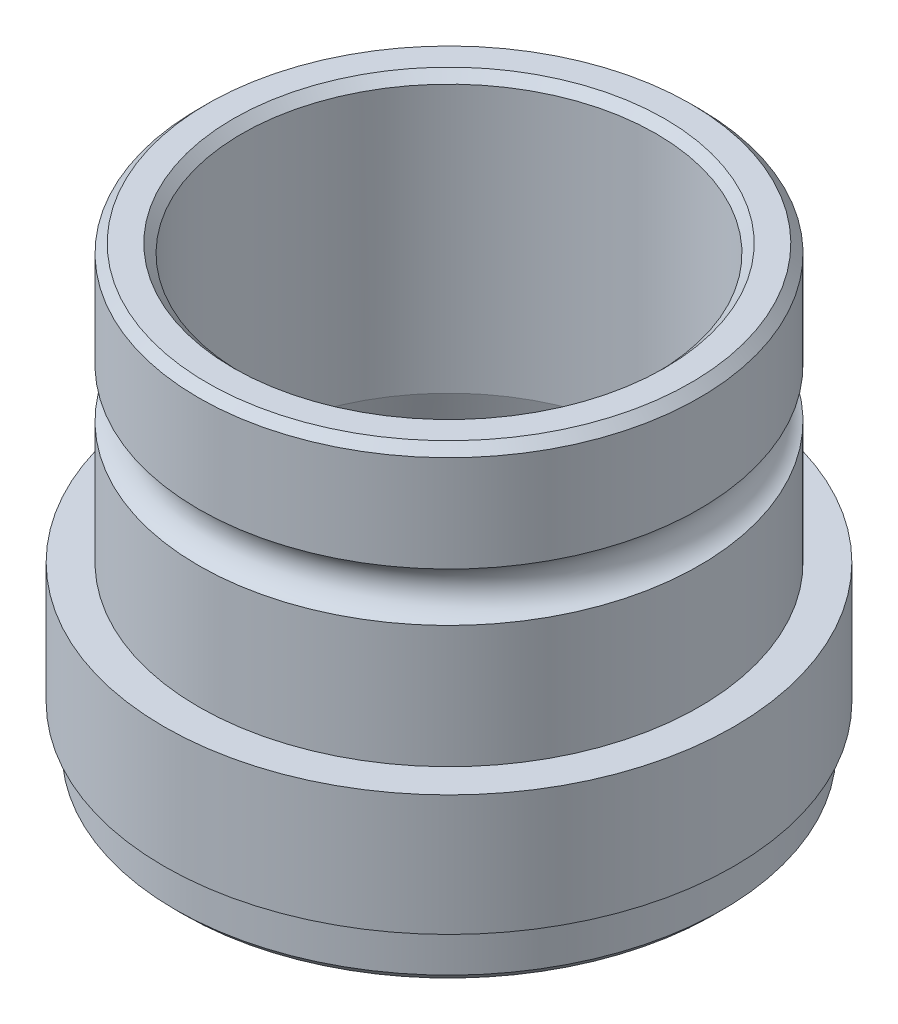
ISO-10303-21;
HEADER;
FILE_DESCRIPTION(('STEP AP214'),'2;1');
FILE_NAME('part.step','',(''),(''),'','','');
FILE_SCHEMA(('AUTOMOTIVE_DESIGN { 1 0 10303 214 1 1 1 1 }'));
ENDSEC;
DATA;
#1=APPLICATION_CONTEXT('core data for automotive mechanical design processes');
#2=APPLICATION_PROTOCOL_DEFINITION('international standard','automotive_design',2000,#1);
#3=PRODUCT_CONTEXT('',#1,'mechanical');
#4=PRODUCT('Part','Part','',(#3));
#5=PRODUCT_RELATED_PRODUCT_CATEGORY('part','',(#4));
#6=PRODUCT_DEFINITION_FORMATION('','',#4);
#7=PRODUCT_DEFINITION_CONTEXT('part definition',#1,'design');
#8=PRODUCT_DEFINITION('design','',#6,#7);
#9=PRODUCT_DEFINITION_SHAPE('','',#8);
#10=(LENGTH_UNIT() NAMED_UNIT(*) SI_UNIT(.MILLI.,.METRE.));
#11=(NAMED_UNIT(*) PLANE_ANGLE_UNIT() SI_UNIT($,.RADIAN.));
#12=(NAMED_UNIT(*) SI_UNIT($,.STERADIAN.) SOLID_ANGLE_UNIT());
#13=UNCERTAINTY_MEASURE_WITH_UNIT(LENGTH_MEASURE(1.E-05),#10,'distance_accuracy_value','');
#14=(GEOMETRIC_REPRESENTATION_CONTEXT(3) GLOBAL_UNCERTAINTY_ASSIGNED_CONTEXT((#13)) GLOBAL_UNIT_ASSIGNED_CONTEXT((#10,
#11,#12)) REPRESENTATION_CONTEXT('',''));
#15=CARTESIAN_POINT('',(0.,0.,0.));
#16=DIRECTION('',(0.,0.,1.));
#17=DIRECTION('',(1.,0.,0.));
#18=AXIS2_PLACEMENT_3D('',#15,#16,#17);
#19=CARTESIAN_POINT('',(0.,18.5,0.));
#20=DIRECTION('',(0.,1.,0.));
#21=DIRECTION('',(0.,0.,1.));
#22=AXIS2_PLACEMENT_3D('',#19,#20,#21);
#23=TOROIDAL_SURFACE('',#22,15.,1.5);
#24=CARTESIAN_POINT('',(0.,19.9142135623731,0.));
#25=DIRECTION('',(0.,1.,0.));
#26=DIRECTION('',(0.,0.,1.));
#27=AXIS2_PLACEMENT_3D('',#24,#25,#26);
#28=CIRCLE('',#27,14.5);
#29=CARTESIAN_POINT('',(0.,19.9142135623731,14.5));
#30=VERTEX_POINT('',#29);
#31=EDGE_CURVE('E106',#30,#30,#28,.T.);
#32=ORIENTED_EDGE('',*,*,#31,.F.);
#33=EDGE_LOOP('',(#32));
#34=FACE_BOUND('',#33,.T.);
#35=CARTESIAN_POINT('',(0.,17.0857864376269,0.));
#36=DIRECTION('',(0.,1.,0.));
#37=DIRECTION('',(0.,0.,1.));
#38=AXIS2_PLACEMENT_3D('',#35,#36,#37);
#39=CIRCLE('',#38,14.5);
#40=CARTESIAN_POINT('',(0.,17.0857864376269,14.5));
#41=VERTEX_POINT('',#40);
#42=EDGE_CURVE('E82',#41,#41,#39,.T.);
#43=ORIENTED_EDGE('',*,*,#42,.T.);
#44=EDGE_LOOP('',(#43));
#45=FACE_BOUND('',#44,.T.);
#46=ADVANCED_FACE('F41',(#34,#45),#23,.F.);
#47=CARTESIAN_POINT('',(0.,26.,0.));
#48=DIRECTION('',(0.,1.,0.));
#49=DIRECTION('',(0.,0.,1.));
#50=AXIS2_PLACEMENT_3D('',#47,#48,#49);
#51=CYLINDRICAL_SURFACE('',#50,14.5);
#52=ORIENTED_EDGE('',*,*,#42,.F.);
#53=EDGE_LOOP('',(#52));
#54=FACE_BOUND('',#53,.T.);
#55=CARTESIAN_POINT('',(0.,10.,0.));
#56=DIRECTION('',(0.,1.,0.));
#57=DIRECTION('',(0.,0.,1.));
#58=AXIS2_PLACEMENT_3D('',#55,#56,#57);
#59=CIRCLE('',#58,14.5);
#60=CARTESIAN_POINT('',(0.,10.,14.5));
#61=VERTEX_POINT('',#60);
#62=EDGE_CURVE('E86',#61,#61,#59,.T.);
#63=ORIENTED_EDGE('',*,*,#62,.T.);
#64=EDGE_LOOP('',(#63));
#65=FACE_BOUND('',#64,.T.);
#66=ADVANCED_FACE('F115',(#54,#65),#51,.T.);
#67=CARTESIAN_POINT('',(0.,10.,0.));
#68=DIRECTION('',(0.,-1.,0.));
#69=DIRECTION('',(0.,0.,-1.));
#70=AXIS2_PLACEMENT_3D('',#67,#68,#69);
#71=PLANE('',#70);
#72=ORIENTED_EDGE('',*,*,#62,.F.);
#73=EDGE_LOOP('',(#72));
#74=FACE_BOUND('',#73,.T.);
#75=CARTESIAN_POINT('',(0.,10.,0.));
#76=DIRECTION('',(0.,1.,0.));
#77=DIRECTION('',(0.,0.,1.));
#78=AXIS2_PLACEMENT_3D('',#75,#76,#77);
#79=CIRCLE('',#78,16.5);
#80=CARTESIAN_POINT('',(0.,10.,16.5));
#81=VERTEX_POINT('',#80);
#82=EDGE_CURVE('E90',#81,#81,#79,.T.);
#83=ORIENTED_EDGE('',*,*,#82,.T.);
#84=EDGE_LOOP('',(#83));
#85=FACE_BOUND('',#84,.T.);
#86=ADVANCED_FACE('F121',(#74,#85),#71,.F.);
#87=CARTESIAN_POINT('',(0.,26.,0.));
#88=DIRECTION('',(0.,1.,0.));
#89=DIRECTION('',(0.,0.,1.));
#90=AXIS2_PLACEMENT_3D('',#87,#88,#89);
#91=CYLINDRICAL_SURFACE('',#90,16.5);
#92=ORIENTED_EDGE('',*,*,#82,.F.);
#93=EDGE_LOOP('',(#92));
#94=FACE_BOUND('',#93,.T.);
#95=CARTESIAN_POINT('',(0.,3.,0.));
#96=DIRECTION('',(0.,1.,0.));
#97=DIRECTION('',(0.,0.,1.));
#98=AXIS2_PLACEMENT_3D('',#95,#96,#97);
#99=CIRCLE('',#98,16.5);
#100=CARTESIAN_POINT('',(0.,3.,16.5));
#101=VERTEX_POINT('',#100);
#102=EDGE_CURVE('E94',#101,#101,#99,.T.);
#103=ORIENTED_EDGE('',*,*,#102,.T.);
#104=EDGE_LOOP('',(#103));
#105=FACE_BOUND('',#104,.T.);
#106=ADVANCED_FACE('F127',(#94,#105),#91,.T.);
#107=CARTESIAN_POINT('',(0.,3.,0.));
#108=DIRECTION('',(0.,1.,0.));
#109=DIRECTION('',(0.,0.,1.));
#110=AXIS2_PLACEMENT_3D('',#107,#108,#109);
#111=PLANE('',#110);
#112=ORIENTED_EDGE('',*,*,#102,.F.);
#113=EDGE_LOOP('',(#112));
#114=FACE_BOUND('',#113,.T.);
#115=CARTESIAN_POINT('',(0.,3.,0.));
#116=DIRECTION('',(0.,1.,0.));
#117=DIRECTION('',(0.,0.,1.));
#118=AXIS2_PLACEMENT_3D('',#115,#116,#117);
#119=CIRCLE('',#118,15.85);
#120=CARTESIAN_POINT('',(0.,3.,15.85));
#121=VERTEX_POINT('',#120);
#122=EDGE_CURVE('E98',#121,#121,#119,.T.);
#123=ORIENTED_EDGE('',*,*,#122,.T.);
#124=EDGE_LOOP('',(#123));
#125=FACE_BOUND('',#124,.T.);
#126=ADVANCED_FACE('F133',(#114,#125),#111,.F.);
#127=CARTESIAN_POINT('',(0.,26.,0.));
#128=DIRECTION('',(0.,1.,0.));
#129=DIRECTION('',(0.,0.,1.));
#130=AXIS2_PLACEMENT_3D('',#127,#128,#129);
#131=CYLINDRICAL_SURFACE('',#130,15.85);
#132=CARTESIAN_POINT('',(0.,0.500000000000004,0.));
#133=DIRECTION('',(0.,1.,0.));
#134=DIRECTION('',(0.,0.,1.));
#135=AXIS2_PLACEMENT_3D('',#132,#133,#134);
#136=CIRCLE('',#135,15.85);
#137=CARTESIAN_POINT('',(0.,0.500000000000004,15.85));
#138=VERTEX_POINT('',#137);
#139=EDGE_CURVE('E66',#138,#138,#136,.T.);
#140=ORIENTED_EDGE('',*,*,#139,.T.);
#141=EDGE_LOOP('',(#140));
#142=FACE_BOUND('',#141,.T.);
#143=ORIENTED_EDGE('',*,*,#122,.F.);
#144=EDGE_LOOP('',(#143));
#145=FACE_BOUND('',#144,.T.);
#146=ADVANCED_FACE('F139',(#142,#145),#131,.T.);
#147=CARTESIAN_POINT('',(0.,0.,0.));
#148=DIRECTION('',(0.,1.,0.));
#149=DIRECTION('',(0.,0.,1.));
#150=AXIS2_PLACEMENT_3D('',#147,#148,#149);
#151=PLANE('',#150);
#152=CARTESIAN_POINT('',(0.,0.,0.));
#153=DIRECTION('',(0.,1.,0.));
#154=DIRECTION('',(0.,0.,1.));
#155=AXIS2_PLACEMENT_3D('',#152,#153,#154);
#156=CIRCLE('',#155,14.6373774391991);
#157=CARTESIAN_POINT('',(0.,0.,14.6373774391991));
#158=VERTEX_POINT('',#157);
#159=EDGE_CURVE('E74',#158,#158,#156,.T.);
#160=ORIENTED_EDGE('',*,*,#159,.T.);
#161=EDGE_LOOP('',(#160));
#162=FACE_BOUND('',#161,.T.);
#163=CARTESIAN_POINT('',(0.,0.,0.));
#164=DIRECTION('',(0.,1.,0.));
#165=DIRECTION('',(0.,0.,1.));
#166=AXIS2_PLACEMENT_3D('',#163,#164,#165);
#167=CIRCLE('',#166,15.35);
#168=CARTESIAN_POINT('',(0.,0.,15.35));
#169=VERTEX_POINT('',#168);
#170=EDGE_CURVE('E78',#169,#169,#167,.F.);
#171=ORIENTED_EDGE('',*,*,#170,.T.);
#172=EDGE_LOOP('',(#171));
#173=FACE_BOUND('',#172,.T.);
#174=ADVANCED_FACE('F144',(#162,#173),#151,.F.);
#175=CARTESIAN_POINT('',(0.,0.,0.));
#176=DIRECTION('',(0.,-1.,0.));
#177=DIRECTION('',(0.,0.,-1.));
#178=AXIS2_PLACEMENT_3D('',#175,#176,#177);
#179=CONICAL_SURFACE('',#178,14.,0.197395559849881);
#180=CARTESIAN_POINT('',(0.,0.490290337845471,0.));
#181=DIRECTION('',(0.,-1.,0.));
#182=DIRECTION('',(0.,0.,-1.));
#183=AXIS2_PLACEMENT_3D('',#180,#181,#182);
#184=CIRCLE('',#183,13.9019419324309);
#185=CARTESIAN_POINT('',(0.,0.490290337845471,-13.9019419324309));
#186=VERTEX_POINT('',#185);
#187=EDGE_CURVE('E70',#186,#186,#184,.T.);
#188=ORIENTED_EDGE('',*,*,#187,.T.);
#189=EDGE_LOOP('',(#188));
#190=FACE_BOUND('',#189,.T.);
#191=CARTESIAN_POINT('',(0.,10.,0.));
#192=DIRECTION('',(0.,1.,0.));
#193=DIRECTION('',(0.,0.,1.));
#194=AXIS2_PLACEMENT_3D('',#191,#192,#193);
#195=CIRCLE('',#194,12.);
#196=CARTESIAN_POINT('',(0.,10.,12.));
#197=VERTEX_POINT('',#196);
#198=EDGE_CURVE('E102',#197,#197,#195,.T.);
#199=ORIENTED_EDGE('',*,*,#198,.T.);
#200=EDGE_LOOP('',(#199));
#201=FACE_BOUND('',#200,.T.);
#202=ADVANCED_FACE('F150',(#190,#201),#179,.F.);
#203=CARTESIAN_POINT('',(0.,26.,0.));
#204=DIRECTION('',(0.,1.,0.));
#205=DIRECTION('',(0.,0.,1.));
#206=AXIS2_PLACEMENT_3D('',#203,#204,#205);
#207=CYLINDRICAL_SURFACE('',#206,12.);
#208=CARTESIAN_POINT('',(0.,25.5,0.));
#209=DIRECTION('',(0.,-1.,0.));
#210=DIRECTION('',(0.,0.,-1.));
#211=AXIS2_PLACEMENT_3D('',#208,#209,#210);
#212=CIRCLE('',#211,12.);
#213=CARTESIAN_POINT('',(0.,25.5,-12.));
#214=VERTEX_POINT('',#213);
#215=EDGE_CURVE('E60',#214,#214,#212,.F.);
#216=ORIENTED_EDGE('',*,*,#215,.T.);
#217=EDGE_LOOP('',(#216));
#218=FACE_BOUND('',#217,.T.);
#219=ORIENTED_EDGE('',*,*,#198,.F.);
#220=EDGE_LOOP('',(#219));
#221=FACE_BOUND('',#220,.T.);
#222=ADVANCED_FACE('F181',(#218,#221),#207,.F.);
#223=CARTESIAN_POINT('',(0.,26.,0.));
#224=DIRECTION('',(0.,-1.,0.));
#225=DIRECTION('',(0.,0.,-1.));
#226=AXIS2_PLACEMENT_3D('',#223,#224,#225);
#227=PLANE('',#226);
#228=CARTESIAN_POINT('',(0.,26.,0.));
#229=DIRECTION('',(0.,-1.,0.));
#230=DIRECTION('',(0.,0.,-1.));
#231=AXIS2_PLACEMENT_3D('',#228,#229,#230);
#232=CIRCLE('',#231,12.5);
#233=CARTESIAN_POINT('',(0.,26.,-12.5));
#234=VERTEX_POINT('',#233);
#235=EDGE_CURVE('E50',#234,#234,#232,.T.);
#236=ORIENTED_EDGE('',*,*,#235,.T.);
#237=EDGE_LOOP('',(#236));
#238=FACE_BOUND('',#237,.T.);
#239=CARTESIAN_POINT('',(0.,26.,0.));
#240=DIRECTION('',(0.,-1.,0.));
#241=DIRECTION('',(0.,0.,-1.));
#242=AXIS2_PLACEMENT_3D('',#239,#240,#241);
#243=CIRCLE('',#242,14.);
#244=CARTESIAN_POINT('',(0.,26.,-14.));
#245=VERTEX_POINT('',#244);
#246=EDGE_CURVE('E55',#245,#245,#243,.F.);
#247=ORIENTED_EDGE('',*,*,#246,.T.);
#248=EDGE_LOOP('',(#247));
#249=FACE_BOUND('',#248,.T.);
#250=ADVANCED_FACE('F184',(#238,#249),#227,.F.);
#251=CARTESIAN_POINT('',(0.,25.5,0.));
#252=DIRECTION('',(0.,-1.,0.));
#253=DIRECTION('',(0.,0.,-1.));
#254=AXIS2_PLACEMENT_3D('',#251,#252,#253);
#255=CIRCLE('',#254,14.5);
#256=CARTESIAN_POINT('',(0.,25.5,-14.5));
#257=VERTEX_POINT('',#256);
#258=EDGE_CURVE('E10',#257,#257,#255,.T.);
#259=ORIENTED_EDGE('',*,*,#258,.T.);
#260=EDGE_LOOP('',(#259));
#261=FACE_BOUND('',#260,.T.);
#262=ORIENTED_EDGE('',*,*,#31,.T.);
#263=EDGE_LOOP('',(#262));
#264=FACE_BOUND('',#263,.T.);
#265=ADVANCED_FACE('F111',(#261,#264),#51,.T.);
#266=CARTESIAN_POINT('',(0.,0.,0.));
#267=DIRECTION('',(0.,-1.,0.));
#268=DIRECTION('',(0.,0.,-1.));
#269=AXIS2_PLACEMENT_3D('',#266,#267,#268);
#270=CONICAL_SURFACE('',#269,14.6373774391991,0.982793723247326);
#271=ORIENTED_EDGE('',*,*,#187,.F.);
#272=EDGE_LOOP('',(#271));
#273=FACE_BOUND('',#272,.T.);
#274=ORIENTED_EDGE('',*,*,#159,.F.);
#275=EDGE_LOOP('',(#274));
#276=FACE_BOUND('',#275,.T.);
#277=ADVANCED_FACE('F156',(#273,#276),#270,.F.);
#278=CARTESIAN_POINT('',(0.,0.500000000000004,0.));
#279=DIRECTION('',(0.,1.,0.));
#280=DIRECTION('',(0.,0.,1.));
#281=AXIS2_PLACEMENT_3D('',#278,#279,#280);
#282=CONICAL_SURFACE('',#281,15.85,0.785398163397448);
#283=ORIENTED_EDGE('',*,*,#170,.F.);
#284=EDGE_LOOP('',(#283));
#285=FACE_BOUND('',#284,.T.);
#286=ORIENTED_EDGE('',*,*,#139,.F.);
#287=EDGE_LOOP('',(#286));
#288=FACE_BOUND('',#287,.T.);
#289=ADVANCED_FACE('F162',(#285,#288),#282,.T.);
#290=CARTESIAN_POINT('',(0.,25.5,0.));
#291=DIRECTION('',(0.,1.,0.));
#292=DIRECTION('',(0.,0.,1.));
#293=AXIS2_PLACEMENT_3D('',#290,#291,#292);
#294=CONICAL_SURFACE('',#293,12.,0.785398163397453);
#295=ORIENTED_EDGE('',*,*,#235,.F.);
#296=EDGE_LOOP('',(#295));
#297=FACE_BOUND('',#296,.T.);
#298=ORIENTED_EDGE('',*,*,#215,.F.);
#299=EDGE_LOOP('',(#298));
#300=FACE_BOUND('',#299,.T.);
#301=ADVANCED_FACE('F168',(#297,#300),#294,.F.);
#302=CARTESIAN_POINT('',(0.,26.,0.));
#303=DIRECTION('',(0.,-1.,0.));
#304=DIRECTION('',(0.,0.,-1.));
#305=AXIS2_PLACEMENT_3D('',#302,#303,#304);
#306=CONICAL_SURFACE('',#305,14.,0.785398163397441);
#307=ORIENTED_EDGE('',*,*,#258,.F.);
#308=EDGE_LOOP('',(#307));
#309=FACE_BOUND('',#308,.T.);
#310=ORIENTED_EDGE('',*,*,#246,.F.);
#311=EDGE_LOOP('',(#310));
#312=FACE_BOUND('',#311,.T.);
#313=ADVANCED_FACE('F44',(#309,#312),#306,.T.);
#314=CLOSED_SHELL('',(#46,#66,#86,#106,#126,#146,#174,#202,#222,#250,#265,#277,#289,#301,#313));
#315=MANIFOLD_SOLID_BREP('B2',#314);
#316=ADVANCED_BREP_SHAPE_REPRESENTATION('',(#18,#315),#14);
#317=SHAPE_DEFINITION_REPRESENTATION(#9,#316);
ENDSEC;
END-ISO-10303-21;
